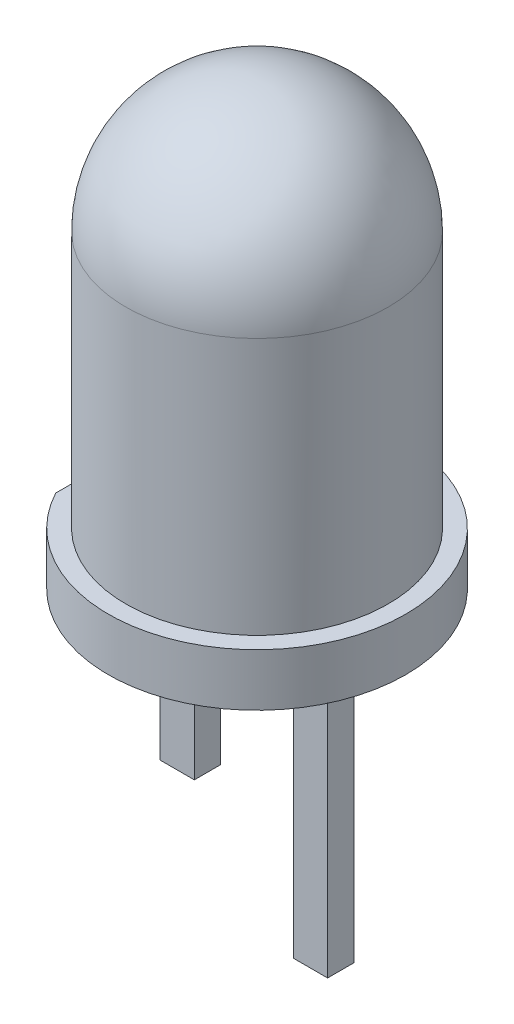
ISO-10303-21;
HEADER;
FILE_DESCRIPTION(('STEP AP214'),'2;1');
FILE_NAME('part.step','',(''),(''),'','','');
FILE_SCHEMA(('AUTOMOTIVE_DESIGN { 1 0 10303 214 1 1 1 1 }'));
ENDSEC;
DATA;
#1=APPLICATION_CONTEXT('core data for automotive mechanical design processes');
#2=APPLICATION_PROTOCOL_DEFINITION('international standard','automotive_design',2000,#1);
#3=PRODUCT_CONTEXT('',#1,'mechanical');
#4=PRODUCT('Part','Part','',(#3));
#5=PRODUCT_RELATED_PRODUCT_CATEGORY('part','',(#4));
#6=PRODUCT_DEFINITION_FORMATION('','',#4);
#7=PRODUCT_DEFINITION_CONTEXT('part definition',#1,'design');
#8=PRODUCT_DEFINITION('design','',#6,#7);
#9=PRODUCT_DEFINITION_SHAPE('','',#8);
#10=(LENGTH_UNIT() NAMED_UNIT(*) SI_UNIT(.MILLI.,.METRE.));
#11=(NAMED_UNIT(*) PLANE_ANGLE_UNIT() SI_UNIT($,.RADIAN.));
#12=(NAMED_UNIT(*) SI_UNIT($,.STERADIAN.) SOLID_ANGLE_UNIT());
#13=UNCERTAINTY_MEASURE_WITH_UNIT(LENGTH_MEASURE(1.E-05),#10,'distance_accuracy_value','');
#14=(GEOMETRIC_REPRESENTATION_CONTEXT(3) GLOBAL_UNCERTAINTY_ASSIGNED_CONTEXT((#13)) GLOBAL_UNIT_ASSIGNED_CONTEXT((#10,
#11,#12)) REPRESENTATION_CONTEXT('',''));
#15=CARTESIAN_POINT('',(0.,0.,0.));
#16=DIRECTION('',(0.,0.,1.));
#17=DIRECTION('',(1.,0.,0.));
#18=AXIS2_PLACEMENT_3D('',#15,#16,#17);
#19=CARTESIAN_POINT('',(-1.595,0.,0.25));
#20=DIRECTION('',(0.,1.,0.));
#21=DIRECTION('',(0.,0.,1.));
#22=AXIS2_PLACEMENT_3D('',#19,#20,#21);
#23=PLANE('',#22);
#24=DIRECTION('',(1.,0.,0.));
#25=VECTOR('',#24,1.);
#26=CARTESIAN_POINT('',(-1.595,0.,-0.25));
#27=LINE('',#26,#25);
#28=CARTESIAN_POINT('',(-1.595,0.,-0.25));
#29=VERTEX_POINT('',#28);
#30=CARTESIAN_POINT('',(-0.945,0.,-0.25));
#31=VERTEX_POINT('',#30);
#32=EDGE_CURVE('E87',#29,#31,#27,.T.);
#33=ORIENTED_EDGE('',*,*,#32,.T.);
#34=DIRECTION('',(0.,0.,-1.));
#35=VECTOR('',#34,1.);
#36=CARTESIAN_POINT('',(-0.945,0.,0.25));
#37=LINE('',#36,#35);
#38=CARTESIAN_POINT('',(-0.945,0.,0.25));
#39=VERTEX_POINT('',#38);
#40=EDGE_CURVE('E12',#39,#31,#37,.T.);
#41=ORIENTED_EDGE('',*,*,#40,.F.);
#42=DIRECTION('',(1.,0.,0.));
#43=VECTOR('',#42,1.);
#44=CARTESIAN_POINT('',(-1.595,0.,0.25));
#45=LINE('',#44,#43);
#46=CARTESIAN_POINT('',(-1.595,0.,0.25));
#47=VERTEX_POINT('',#46);
#48=EDGE_CURVE('E108',#47,#39,#45,.T.);
#49=ORIENTED_EDGE('',*,*,#48,.F.);
#50=DIRECTION('',(0.,0.,-1.));
#51=VECTOR('',#50,1.);
#52=CARTESIAN_POINT('',(-1.595,0.,0.25));
#53=LINE('',#52,#51);
#54=EDGE_CURVE('E100',#47,#29,#53,.T.);
#55=ORIENTED_EDGE('',*,*,#54,.T.);
#56=EDGE_LOOP('',(#33,#41,#49,#55));
#57=FACE_BOUND('',#56,.T.);
#58=ADVANCED_FACE('F37',(#57),#23,.F.);
#59=CARTESIAN_POINT('',(-0.945,0.,0.25));
#60=DIRECTION('',(-1.,0.,0.));
#61=DIRECTION('',(0.,0.,1.));
#62=AXIS2_PLACEMENT_3D('',#59,#60,#61);
#63=PLANE('',#62);
#64=DIRECTION('',(0.,1.,0.));
#65=VECTOR('',#64,1.);
#66=CARTESIAN_POINT('',(-0.945,0.,-0.25));
#67=LINE('',#66,#65);
#68=CARTESIAN_POINT('',(-0.945,0.271653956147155,-0.25));
#69=VERTEX_POINT('',#68);
#70=EDGE_CURVE('E83',#31,#69,#67,.T.);
#71=ORIENTED_EDGE('',*,*,#70,.T.);
#72=DIRECTION('',(0.,0.,-1.));
#73=VECTOR('',#72,1.);
#74=CARTESIAN_POINT('',(-0.945,0.271653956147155,0.25));
#75=LINE('',#74,#73);
#76=CARTESIAN_POINT('',(-0.945,0.271653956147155,0.25));
#77=VERTEX_POINT('',#76);
#78=EDGE_CURVE('E44',#77,#69,#75,.T.);
#79=ORIENTED_EDGE('',*,*,#78,.F.);
#80=DIRECTION('',(0.,1.,0.));
#81=VECTOR('',#80,1.);
#82=CARTESIAN_POINT('',(-0.945,0.,0.25));
#83=LINE('',#82,#81);
#84=EDGE_CURVE('E96',#39,#77,#83,.T.);
#85=ORIENTED_EDGE('',*,*,#84,.F.);
#86=ORIENTED_EDGE('',*,*,#40,.T.);
#87=EDGE_LOOP('',(#71,#79,#85,#86));
#88=FACE_BOUND('',#87,.T.);
#89=ADVANCED_FACE('F95',(#88),#63,.F.);
#90=CARTESIAN_POINT('',(-0.945,0.271653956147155,0.25));
#91=DIRECTION('',(-0.485529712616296,0.874220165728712,0.));
#92=DIRECTION('',(-0.874220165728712,-0.485529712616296,0.));
#93=AXIS2_PLACEMENT_3D('',#90,#91,#92);
#94=PLANE('',#93);
#95=DIRECTION('',(0.874220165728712,0.485529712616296,0.));
#96=VECTOR('',#95,1.);
#97=CARTESIAN_POINT('',(-0.945,0.271653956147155,-0.25));
#98=LINE('',#97,#96);
#99=CARTESIAN_POINT('',(-0.32399866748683,0.616549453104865,-0.25));
#100=VERTEX_POINT('',#99);
#101=EDGE_CURVE('E89',#69,#100,#98,.T.);
#102=ORIENTED_EDGE('',*,*,#101,.T.);
#103=DIRECTION('',(0.,0.,-1.));
#104=VECTOR('',#103,1.);
#105=CARTESIAN_POINT('',(-0.32399866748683,0.616549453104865,0.25));
#106=LINE('',#105,#104);
#107=CARTESIAN_POINT('',(-0.32399866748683,0.616549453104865,0.25));
#108=VERTEX_POINT('',#107);
#109=EDGE_CURVE('E119',#108,#100,#106,.T.);
#110=ORIENTED_EDGE('',*,*,#109,.F.);
#111=DIRECTION('',(0.874220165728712,0.485529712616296,0.));
#112=VECTOR('',#111,1.);
#113=CARTESIAN_POINT('',(-0.945,0.271653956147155,0.25));
#114=LINE('',#113,#112);
#115=EDGE_CURVE('E111',#77,#108,#114,.T.);
#116=ORIENTED_EDGE('',*,*,#115,.F.);
#117=ORIENTED_EDGE('',*,*,#78,.T.);
#118=EDGE_LOOP('',(#102,#110,#116,#117));
#119=FACE_BOUND('',#118,.T.);
#120=ADVANCED_FACE('F123',(#119),#94,.F.);
#121=CARTESIAN_POINT('',(-1.595,3.29327204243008,0.25));
#122=DIRECTION('',(-0.9033352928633,-0.428935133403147,0.));
#123=DIRECTION('',(0.428935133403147,-0.9033352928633,0.));
#124=AXIS2_PLACEMENT_3D('',#121,#122,#123);
#125=PLANE('',#124);
#126=DIRECTION('',(-0.428935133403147,0.9033352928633,0.));
#127=VECTOR('',#126,1.);
#128=CARTESIAN_POINT('',(-1.595,3.29327204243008,-0.25));
#129=LINE('',#128,#127);
#130=CARTESIAN_POINT('',(-1.595,3.29327204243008,-0.25));
#131=VERTEX_POINT('',#130);
#132=EDGE_CURVE('E104',#100,#131,#129,.T.);
#133=ORIENTED_EDGE('',*,*,#132,.T.);
#134=DIRECTION('',(0.,0.,-1.));
#135=VECTOR('',#134,1.);
#136=CARTESIAN_POINT('',(-1.595,3.29327204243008,0.25));
#137=LINE('',#136,#135);
#138=CARTESIAN_POINT('',(-1.595,3.29327204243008,0.25));
#139=VERTEX_POINT('',#138);
#140=EDGE_CURVE('E116',#139,#131,#137,.T.);
#141=ORIENTED_EDGE('',*,*,#140,.F.);
#142=DIRECTION('',(-0.428935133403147,0.9033352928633,0.));
#143=VECTOR('',#142,1.);
#144=CARTESIAN_POINT('',(-1.595,3.29327204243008,0.25));
#145=LINE('',#144,#143);
#146=EDGE_CURVE('E56',#108,#139,#145,.T.);
#147=ORIENTED_EDGE('',*,*,#146,.F.);
#148=ORIENTED_EDGE('',*,*,#109,.T.);
#149=EDGE_LOOP('',(#133,#141,#147,#148));
#150=FACE_BOUND('',#149,.T.);
#151=ADVANCED_FACE('F134',(#150),#125,.F.);
#152=CARTESIAN_POINT('',(-1.595,0.,0.25));
#153=DIRECTION('',(1.,0.,0.));
#154=DIRECTION('',(0.,0.,-1.));
#155=AXIS2_PLACEMENT_3D('',#152,#153,#154);
#156=PLANE('',#155);
#157=DIRECTION('',(0.,-1.,0.));
#158=VECTOR('',#157,1.);
#159=CARTESIAN_POINT('',(-1.595,0.,-0.25));
#160=LINE('',#159,#158);
#161=EDGE_CURVE('E106',#131,#29,#160,.T.);
#162=ORIENTED_EDGE('',*,*,#161,.T.);
#163=ORIENTED_EDGE('',*,*,#54,.F.);
#164=DIRECTION('',(0.,-1.,0.));
#165=VECTOR('',#164,1.);
#166=CARTESIAN_POINT('',(-1.595,0.,0.25));
#167=LINE('',#166,#165);
#168=EDGE_CURVE('E51',#139,#47,#167,.T.);
#169=ORIENTED_EDGE('',*,*,#168,.F.);
#170=ORIENTED_EDGE('',*,*,#140,.T.);
#171=EDGE_LOOP('',(#162,#163,#169,#170));
#172=FACE_BOUND('',#171,.T.);
#173=ADVANCED_FACE('F127',(#172),#156,.F.);
#174=CARTESIAN_POINT('',(-0.945,0.,0.25));
#175=DIRECTION('',(0.,0.,1.));
#176=DIRECTION('',(1.,0.,0.));
#177=AXIS2_PLACEMENT_3D('',#174,#175,#176);
#178=PLANE('',#177);
#179=ORIENTED_EDGE('',*,*,#48,.T.);
#180=ORIENTED_EDGE('',*,*,#84,.T.);
#181=ORIENTED_EDGE('',*,*,#115,.T.);
#182=ORIENTED_EDGE('',*,*,#146,.T.);
#183=ORIENTED_EDGE('',*,*,#168,.T.);
#184=EDGE_LOOP('',(#179,#180,#181,#182,#183));
#185=FACE_BOUND('',#184,.T.);
#186=ADVANCED_FACE('F125',(#185),#178,.T.);
#187=CARTESIAN_POINT('',(-0.945,0.,-0.25));
#188=DIRECTION('',(0.,0.,1.));
#189=DIRECTION('',(1.,0.,0.));
#190=AXIS2_PLACEMENT_3D('',#187,#188,#189);
#191=PLANE('',#190);
#192=ORIENTED_EDGE('',*,*,#32,.F.);
#193=ORIENTED_EDGE('',*,*,#161,.F.);
#194=ORIENTED_EDGE('',*,*,#132,.F.);
#195=ORIENTED_EDGE('',*,*,#101,.F.);
#196=ORIENTED_EDGE('',*,*,#70,.F.);
#197=EDGE_LOOP('',(#192,#193,#194,#195,#196));
#198=FACE_BOUND('',#197,.T.);
#199=ADVANCED_FACE('F84',(#198),#191,.F.);
#200=CLOSED_SHELL('',(#58,#89,#120,#151,#173,#186,#199));
#201=MANIFOLD_SOLID_BREP('B2',#200);
#202=CARTESIAN_POINT('',(1.595,0.,0.25));
#203=DIRECTION('',(0.,1.,0.));
#204=DIRECTION('',(0.,0.,1.));
#205=AXIS2_PLACEMENT_3D('',#202,#203,#204);
#206=PLANE('',#205);
#207=DIRECTION('',(1.,0.,0.));
#208=VECTOR('',#207,1.);
#209=CARTESIAN_POINT('',(1.595,0.,-0.25));
#210=LINE('',#209,#208);
#211=CARTESIAN_POINT('',(0.945,0.,-0.25));
#212=VERTEX_POINT('',#211);
#213=CARTESIAN_POINT('',(1.595,0.,-0.25));
#214=VERTEX_POINT('',#213);
#215=EDGE_CURVE('E255',#212,#214,#210,.T.);
#216=ORIENTED_EDGE('',*,*,#215,.T.);
#217=DIRECTION('',(0.,0.,-1.));
#218=VECTOR('',#217,1.);
#219=CARTESIAN_POINT('',(1.595,0.,0.25));
#220=LINE('',#219,#218);
#221=CARTESIAN_POINT('',(1.595,0.,0.25));
#222=VERTEX_POINT('',#221);
#223=EDGE_CURVE('E35',#222,#214,#220,.T.);
#224=ORIENTED_EDGE('',*,*,#223,.F.);
#225=DIRECTION('',(1.,0.,0.));
#226=VECTOR('',#225,1.);
#227=CARTESIAN_POINT('',(1.595,0.,0.25));
#228=LINE('',#227,#226);
#229=CARTESIAN_POINT('',(0.945,0.,0.25));
#230=VERTEX_POINT('',#229);
#231=EDGE_CURVE('E284',#230,#222,#228,.T.);
#232=ORIENTED_EDGE('',*,*,#231,.F.);
#233=DIRECTION('',(0.,0.,-1.));
#234=VECTOR('',#233,1.);
#235=CARTESIAN_POINT('',(0.945,0.,0.25));
#236=LINE('',#235,#234);
#237=EDGE_CURVE('E268',#230,#212,#236,.T.);
#238=ORIENTED_EDGE('',*,*,#237,.T.);
#239=EDGE_LOOP('',(#216,#224,#232,#238));
#240=FACE_BOUND('',#239,.T.);
#241=ADVANCED_FACE('F181',(#240),#206,.F.);
#242=CARTESIAN_POINT('',(1.595,0.,0.25));
#243=DIRECTION('',(-1.,0.,0.));
#244=DIRECTION('',(0.,-1.,0.));
#245=AXIS2_PLACEMENT_3D('',#242,#243,#244);
#246=PLANE('',#245);
#247=DIRECTION('',(0.,1.,0.));
#248=VECTOR('',#247,1.);
#249=CARTESIAN_POINT('',(1.595,0.,-0.25));
#250=LINE('',#249,#248);
#251=CARTESIAN_POINT('',(1.595,3.5,-0.25));
#252=VERTEX_POINT('',#251);
#253=EDGE_CURVE('E251',#214,#252,#250,.T.);
#254=ORIENTED_EDGE('',*,*,#253,.T.);
#255=DIRECTION('',(0.,0.,-1.));
#256=VECTOR('',#255,1.);
#257=CARTESIAN_POINT('',(1.595,3.5,0.25));
#258=LINE('',#257,#256);
#259=CARTESIAN_POINT('',(1.595,3.5,0.25));
#260=VERTEX_POINT('',#259);
#261=EDGE_CURVE('E188',#260,#252,#258,.T.);
#262=ORIENTED_EDGE('',*,*,#261,.F.);
#263=DIRECTION('',(0.,1.,0.));
#264=VECTOR('',#263,1.);
#265=CARTESIAN_POINT('',(1.595,0.,0.25));
#266=LINE('',#265,#264);
#267=EDGE_CURVE('E264',#222,#260,#266,.T.);
#268=ORIENTED_EDGE('',*,*,#267,.F.);
#269=ORIENTED_EDGE('',*,*,#223,.T.);
#270=EDGE_LOOP('',(#254,#262,#268,#269));
#271=FACE_BOUND('',#270,.T.);
#272=ADVANCED_FACE('F263',(#271),#246,.F.);
#273=CARTESIAN_POINT('',(1.595,3.5,0.25));
#274=DIRECTION('',(0.,-1.,0.));
#275=DIRECTION('',(0.,0.,-1.));
#276=AXIS2_PLACEMENT_3D('',#273,#274,#275);
#277=PLANE('',#276);
#278=DIRECTION('',(-1.,0.,0.));
#279=VECTOR('',#278,1.);
#280=CARTESIAN_POINT('',(1.595,3.5,-0.25));
#281=LINE('',#280,#279);
#282=CARTESIAN_POINT('',(0.80632764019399,3.5,-0.25));
#283=VERTEX_POINT('',#282);
#284=EDGE_CURVE('E257',#252,#283,#281,.T.);
#285=ORIENTED_EDGE('',*,*,#284,.T.);
#286=DIRECTION('',(0.,0.,-1.));
#287=VECTOR('',#286,1.);
#288=CARTESIAN_POINT('',(0.80632764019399,3.5,0.25));
#289=LINE('',#288,#287);
#290=CARTESIAN_POINT('',(0.80632764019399,3.5,0.25));
#291=VERTEX_POINT('',#290);
#292=EDGE_CURVE('E315',#291,#283,#289,.T.);
#293=ORIENTED_EDGE('',*,*,#292,.F.);
#294=DIRECTION('',(-1.,0.,0.));
#295=VECTOR('',#294,1.);
#296=CARTESIAN_POINT('',(1.595,3.5,0.25));
#297=LINE('',#296,#295);
#298=EDGE_CURVE('E287',#260,#291,#297,.T.);
#299=ORIENTED_EDGE('',*,*,#298,.F.);
#300=ORIENTED_EDGE('',*,*,#261,.T.);
#301=EDGE_LOOP('',(#285,#293,#299,#300));
#302=FACE_BOUND('',#301,.T.);
#303=ADVANCED_FACE('F319',(#302),#277,.F.);
#304=CARTESIAN_POINT('',(0.80632764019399,3.5,0.25));
#305=DIRECTION('',(0.796529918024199,-0.604599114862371,0.));
#306=DIRECTION('',(0.604599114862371,0.796529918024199,0.));
#307=AXIS2_PLACEMENT_3D('',#304,#305,#306);
#308=PLANE('',#307);
#309=DIRECTION('',(-0.604599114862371,-0.796529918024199,0.));
#310=VECTOR('',#309,1.);
#311=CARTESIAN_POINT('',(0.80632764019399,3.5,-0.25));
#312=LINE('',#311,#310);
#313=CARTESIAN_POINT('',(0.521534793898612,3.12479928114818,-0.25));
#314=VERTEX_POINT('',#313);
#315=EDGE_CURVE('E272',#283,#314,#312,.T.);
#316=ORIENTED_EDGE('',*,*,#315,.T.);
#317=DIRECTION('',(0.,0.,-1.));
#318=VECTOR('',#317,1.);
#319=CARTESIAN_POINT('',(0.521534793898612,3.12479928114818,0.25));
#320=LINE('',#319,#318);
#321=CARTESIAN_POINT('',(0.521534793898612,3.12479928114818,0.25));
#322=VERTEX_POINT('',#321);
#323=EDGE_CURVE('E312',#322,#314,#320,.T.);
#324=ORIENTED_EDGE('',*,*,#323,.F.);
#325=DIRECTION('',(-0.604599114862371,-0.796529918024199,0.));
#326=VECTOR('',#325,1.);
#327=CARTESIAN_POINT('',(0.80632764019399,3.5,0.25));
#328=LINE('',#327,#326);
#329=EDGE_CURVE('E289',#291,#322,#328,.T.);
#330=ORIENTED_EDGE('',*,*,#329,.F.);
#331=ORIENTED_EDGE('',*,*,#292,.T.);
#332=EDGE_LOOP('',(#316,#324,#330,#331));
#333=FACE_BOUND('',#332,.T.);
#334=ADVANCED_FACE('F327',(#333),#308,.F.);
#335=CARTESIAN_POINT('',(0.123269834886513,3.42709883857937,0.25));
#336=DIRECTION('',(0.,0.,-1.));
#337=DIRECTION('',(-1.,0.,0.));
#338=AXIS2_PLACEMENT_3D('',#335,#336,#337);
#339=CYLINDRICAL_SURFACE('',#338,0.5);
#340=CARTESIAN_POINT('',(0.123269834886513,3.42709883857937,-0.25));
#341=DIRECTION('',(0.,0.,-1.));
#342=DIRECTION('',(1.,0.,0.));
#343=AXIS2_PLACEMENT_3D('',#340,#341,#342);
#344=CIRCLE('',#343,0.5);
#345=CARTESIAN_POINT('',(-0.103725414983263,2.98159557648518,-0.25));
#346=VERTEX_POINT('',#345);
#347=EDGE_CURVE('E274',#314,#346,#344,.T.);
#348=ORIENTED_EDGE('',*,*,#347,.T.);
#349=DIRECTION('',(0.,0.,-1.));
#350=VECTOR('',#349,1.);
#351=CARTESIAN_POINT('',(-0.103725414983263,2.98159557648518,0.25));
#352=LINE('',#351,#350);
#353=CARTESIAN_POINT('',(-0.103725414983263,2.98159557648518,0.25));
#354=VERTEX_POINT('',#353);
#355=EDGE_CURVE('E309',#354,#346,#352,.T.);
#356=ORIENTED_EDGE('',*,*,#355,.F.);
#357=CARTESIAN_POINT('',(0.123269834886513,3.42709883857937,0.25));
#358=DIRECTION('',(0.,0.,-1.));
#359=DIRECTION('',(1.,0.,0.));
#360=AXIS2_PLACEMENT_3D('',#357,#358,#359);
#361=CIRCLE('',#360,0.5);
#362=EDGE_CURVE('E291',#322,#354,#361,.T.);
#363=ORIENTED_EDGE('',*,*,#362,.F.);
#364=ORIENTED_EDGE('',*,*,#323,.T.);
#365=EDGE_LOOP('',(#348,#356,#363,#364));
#366=FACE_BOUND('',#365,.T.);
#367=ADVANCED_FACE('F330',(#366),#339,.F.);
#368=CARTESIAN_POINT('',(-1.29298369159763,3.58755293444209,0.25));
#369=DIRECTION('',(-0.453990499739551,-0.891006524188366,0.));
#370=DIRECTION('',(0.891006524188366,-0.453990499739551,0.));
#371=AXIS2_PLACEMENT_3D('',#368,#369,#370);
#372=PLANE('',#371);
#373=DIRECTION('',(-0.891006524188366,0.453990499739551,0.));
#374=VECTOR('',#373,1.);
#375=CARTESIAN_POINT('',(-1.29298369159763,3.58755293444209,-0.25));
#376=LINE('',#375,#374);
#377=CARTESIAN_POINT('',(-1.29298369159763,3.58755293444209,-0.25));
#378=VERTEX_POINT('',#377);
#379=EDGE_CURVE('E276',#346,#378,#376,.T.);
#380=ORIENTED_EDGE('',*,*,#379,.T.);
#381=DIRECTION('',(0.,0.,-1.));
#382=VECTOR('',#381,1.);
#383=CARTESIAN_POINT('',(-1.29298369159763,3.58755293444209,0.25));
#384=LINE('',#383,#382);
#385=CARTESIAN_POINT('',(-1.29298369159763,3.58755293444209,0.25));
#386=VERTEX_POINT('',#385);
#387=EDGE_CURVE('E306',#386,#378,#384,.T.);
#388=ORIENTED_EDGE('',*,*,#387,.F.);
#389=DIRECTION('',(-0.891006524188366,0.453990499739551,0.));
#390=VECTOR('',#389,1.);
#391=CARTESIAN_POINT('',(-1.29298369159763,3.58755293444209,0.25));
#392=LINE('',#391,#390);
#393=EDGE_CURVE('E293',#354,#386,#392,.T.);
#394=ORIENTED_EDGE('',*,*,#393,.F.);
#395=ORIENTED_EDGE('',*,*,#355,.T.);
#396=EDGE_LOOP('',(#380,#388,#394,#395));
#397=FACE_BOUND('',#396,.T.);
#398=ADVANCED_FACE('F335',(#397),#372,.F.);
#399=CARTESIAN_POINT('',(0.231099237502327,0.377841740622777,0.25));
#400=DIRECTION('',(0.9033352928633,0.428935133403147,0.));
#401=DIRECTION('',(-0.428935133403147,0.9033352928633,0.));
#402=AXIS2_PLACEMENT_3D('',#399,#400,#401);
#403=PLANE('',#402);
#404=DIRECTION('',(0.428935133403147,-0.9033352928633,0.));
#405=VECTOR('',#404,1.);
#406=CARTESIAN_POINT('',(0.231099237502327,0.377841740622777,-0.25));
#407=LINE('',#406,#405);
#408=CARTESIAN_POINT('',(0.231099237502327,0.377841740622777,-0.25));
#409=VERTEX_POINT('',#408);
#410=EDGE_CURVE('E278',#378,#409,#407,.T.);
#411=ORIENTED_EDGE('',*,*,#410,.T.);
#412=DIRECTION('',(0.,0.,-1.));
#413=VECTOR('',#412,1.);
#414=CARTESIAN_POINT('',(0.231099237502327,0.377841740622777,0.25));
#415=LINE('',#414,#413);
#416=CARTESIAN_POINT('',(0.231099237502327,0.377841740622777,0.25));
#417=VERTEX_POINT('',#416);
#418=EDGE_CURVE('E303',#417,#409,#415,.T.);
#419=ORIENTED_EDGE('',*,*,#418,.F.);
#420=DIRECTION('',(0.428935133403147,-0.9033352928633,0.));
#421=VECTOR('',#420,1.);
#422=CARTESIAN_POINT('',(0.231099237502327,0.377841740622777,0.25));
#423=LINE('',#422,#421);
#424=EDGE_CURVE('E295',#386,#417,#423,.T.);
#425=ORIENTED_EDGE('',*,*,#424,.F.);
#426=ORIENTED_EDGE('',*,*,#387,.T.);
#427=EDGE_LOOP('',(#411,#419,#425,#426));
#428=FACE_BOUND('',#427,.T.);
#429=ADVANCED_FACE('F339',(#428),#403,.F.);
#430=CARTESIAN_POINT('',(0.945,0.23,0.25));
#431=DIRECTION('',(0.202787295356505,0.979222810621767,0.));
#432=DIRECTION('',(-0.979222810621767,0.202787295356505,0.));
#433=AXIS2_PLACEMENT_3D('',#430,#431,#432);
#434=PLANE('',#433);
#435=DIRECTION('',(0.979222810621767,-0.202787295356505,0.));
#436=VECTOR('',#435,1.);
#437=CARTESIAN_POINT('',(0.945,0.23,-0.25));
#438=LINE('',#437,#436);
#439=CARTESIAN_POINT('',(0.945,0.23,-0.25));
#440=VERTEX_POINT('',#439);
#441=EDGE_CURVE('E280',#409,#440,#438,.T.);
#442=ORIENTED_EDGE('',*,*,#441,.T.);
#443=DIRECTION('',(0.,0.,-1.));
#444=VECTOR('',#443,1.);
#445=CARTESIAN_POINT('',(0.945,0.23,0.25));
#446=LINE('',#445,#444);
#447=CARTESIAN_POINT('',(0.945,0.23,0.25));
#448=VERTEX_POINT('',#447);
#449=EDGE_CURVE('E300',#448,#440,#446,.T.);
#450=ORIENTED_EDGE('',*,*,#449,.F.);
#451=DIRECTION('',(0.979222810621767,-0.202787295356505,0.));
#452=VECTOR('',#451,1.);
#453=CARTESIAN_POINT('',(0.945,0.23,0.25));
#454=LINE('',#453,#452);
#455=EDGE_CURVE('E200',#417,#448,#454,.T.);
#456=ORIENTED_EDGE('',*,*,#455,.F.);
#457=ORIENTED_EDGE('',*,*,#418,.T.);
#458=EDGE_LOOP('',(#442,#450,#456,#457));
#459=FACE_BOUND('',#458,.T.);
#460=ADVANCED_FACE('F343',(#459),#434,.F.);
#461=CARTESIAN_POINT('',(0.945,0.,0.25));
#462=DIRECTION('',(1.,0.,0.));
#463=DIRECTION('',(0.,0.,-1.));
#464=AXIS2_PLACEMENT_3D('',#461,#462,#463);
#465=PLANE('',#464);
#466=DIRECTION('',(0.,-1.,0.));
#467=VECTOR('',#466,1.);
#468=CARTESIAN_POINT('',(0.945,0.,-0.25));
#469=LINE('',#468,#467);
#470=EDGE_CURVE('E282',#440,#212,#469,.T.);
#471=ORIENTED_EDGE('',*,*,#470,.T.);
#472=ORIENTED_EDGE('',*,*,#237,.F.);
#473=DIRECTION('',(0.,-1.,0.));
#474=VECTOR('',#473,1.);
#475=CARTESIAN_POINT('',(0.945,0.,0.25));
#476=LINE('',#475,#474);
#477=EDGE_CURVE('E195',#448,#230,#476,.T.);
#478=ORIENTED_EDGE('',*,*,#477,.F.);
#479=ORIENTED_EDGE('',*,*,#449,.T.);
#480=EDGE_LOOP('',(#471,#472,#478,#479));
#481=FACE_BOUND('',#480,.T.);
#482=ADVANCED_FACE('F345',(#481),#465,.F.);
#483=CARTESIAN_POINT('',(0.123269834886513,3.42709883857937,0.25));
#484=DIRECTION('',(0.,0.,1.));
#485=DIRECTION('',(1.,0.,0.));
#486=AXIS2_PLACEMENT_3D('',#483,#484,#485);
#487=PLANE('',#486);
#488=ORIENTED_EDGE('',*,*,#231,.T.);
#489=ORIENTED_EDGE('',*,*,#267,.T.);
#490=ORIENTED_EDGE('',*,*,#298,.T.);
#491=ORIENTED_EDGE('',*,*,#329,.T.);
#492=ORIENTED_EDGE('',*,*,#362,.T.);
#493=ORIENTED_EDGE('',*,*,#393,.T.);
#494=ORIENTED_EDGE('',*,*,#424,.T.);
#495=ORIENTED_EDGE('',*,*,#455,.T.);
#496=ORIENTED_EDGE('',*,*,#477,.T.);
#497=EDGE_LOOP('',(#488,#489,#490,#491,#492,#493,#494,#495,#496));
#498=FACE_BOUND('',#497,.T.);
#499=ADVANCED_FACE('F322',(#498),#487,.T.);
#500=CARTESIAN_POINT('',(0.123269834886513,3.42709883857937,-0.25));
#501=DIRECTION('',(0.,0.,1.));
#502=DIRECTION('',(1.,0.,0.));
#503=AXIS2_PLACEMENT_3D('',#500,#501,#502);
#504=PLANE('',#503);
#505=ORIENTED_EDGE('',*,*,#215,.F.);
#506=ORIENTED_EDGE('',*,*,#470,.F.);
#507=ORIENTED_EDGE('',*,*,#441,.F.);
#508=ORIENTED_EDGE('',*,*,#410,.F.);
#509=ORIENTED_EDGE('',*,*,#379,.F.);
#510=ORIENTED_EDGE('',*,*,#347,.F.);
#511=ORIENTED_EDGE('',*,*,#315,.F.);
#512=ORIENTED_EDGE('',*,*,#284,.F.);
#513=ORIENTED_EDGE('',*,*,#253,.F.);
#514=EDGE_LOOP('',(#505,#506,#507,#508,#509,#510,#511,#512,#513));
#515=FACE_BOUND('',#514,.T.);
#516=ADVANCED_FACE('F252',(#515),#504,.F.);
#517=CLOSED_SHELL('',(#241,#272,#303,#334,#367,#398,#429,#460,#482,#499,#516));
#518=MANIFOLD_SOLID_BREP('B6',#517);
#519=CARTESIAN_POINT('',(-2.835,0.,0.));
#520=DIRECTION('',(0.,1.,0.));
#521=DIRECTION('',(0.,0.,1.));
#522=AXIS2_PLACEMENT_3D('',#519,#520,#521);
#523=PLANE('',#522);
#524=DIRECTION('',(-1.,0.,0.));
#525=VECTOR('',#524,1.);
#526=CARTESIAN_POINT('',(-0.945,0.,0.25));
#527=LINE('',#526,#525);
#528=CARTESIAN_POINT('',(-0.945,0.,0.25));
#529=VERTEX_POINT('',#528);
#530=CARTESIAN_POINT('',(-1.595,0.,0.25));
#531=VERTEX_POINT('',#530);
#532=EDGE_CURVE('E588',#529,#531,#527,.T.);
#533=ORIENTED_EDGE('',*,*,#532,.F.);
#534=DIRECTION('',(0.,0.,1.));
#535=VECTOR('',#534,1.);
#536=CARTESIAN_POINT('',(-0.945,0.,0.25));
#537=LINE('',#536,#535);
#538=CARTESIAN_POINT('',(-0.945,0.,-0.25));
#539=VERTEX_POINT('',#538);
#540=EDGE_CURVE('E509',#539,#529,#537,.T.);
#541=ORIENTED_EDGE('',*,*,#540,.F.);
#542=DIRECTION('',(1.,0.,0.));
#543=VECTOR('',#542,1.);
#544=CARTESIAN_POINT('',(-0.945,0.,-0.25));
#545=LINE('',#544,#543);
#546=CARTESIAN_POINT('',(-1.595,0.,-0.25));
#547=VERTEX_POINT('',#546);
#548=EDGE_CURVE('E514',#547,#539,#545,.T.);
#549=ORIENTED_EDGE('',*,*,#548,.F.);
#550=DIRECTION('',(0.,0.,-1.));
#551=VECTOR('',#550,1.);
#552=CARTESIAN_POINT('',(-1.595,0.,0.25));
#553=LINE('',#552,#551);
#554=EDGE_CURVE('E590',#531,#547,#553,.T.);
#555=ORIENTED_EDGE('',*,*,#554,.F.);
#556=EDGE_LOOP('',(#533,#541,#549,#555));
#557=FACE_BOUND('',#556,.T.);
#558=CARTESIAN_POINT('',(0.,0.,0.));
#559=DIRECTION('',(0.,-1.,0.));
#560=DIRECTION('',(0.,0.,-1.));
#561=AXIS2_PLACEMENT_3D('',#558,#559,#560);
#562=CIRCLE('',#561,2.835);
#563=CARTESIAN_POINT('',(-2.5,0.,-1.33687134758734));
#564=VERTEX_POINT('',#563);
#565=CARTESIAN_POINT('',(-2.5,0.,1.33687134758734));
#566=VERTEX_POINT('',#565);
#567=EDGE_CURVE('E179',#564,#566,#562,.T.);
#568=ORIENTED_EDGE('',*,*,#567,.T.);
#569=DIRECTION('',(0.,0.,1.));
#570=VECTOR('',#569,1.);
#571=CARTESIAN_POINT('',(-2.5,0.,-5.));
#572=LINE('',#571,#570);
#573=EDGE_CURVE('E521',#564,#566,#572,.T.);
#574=ORIENTED_EDGE('',*,*,#573,.F.);
#575=EDGE_LOOP('',(#568,#574));
#576=FACE_BOUND('',#575,.T.);
#577=DIRECTION('',(0.,0.,-1.));
#578=VECTOR('',#577,1.);
#579=CARTESIAN_POINT('',(0.945,0.,0.25));
#580=LINE('',#579,#578);
#581=CARTESIAN_POINT('',(0.945,0.,0.25));
#582=VERTEX_POINT('',#581);
#583=CARTESIAN_POINT('',(0.945,0.,-0.25));
#584=VERTEX_POINT('',#583);
#585=EDGE_CURVE('E553',#582,#584,#580,.T.);
#586=ORIENTED_EDGE('',*,*,#585,.F.);
#587=DIRECTION('',(-1.,0.,0.));
#588=VECTOR('',#587,1.);
#589=CARTESIAN_POINT('',(0.945,0.,0.25));
#590=LINE('',#589,#588);
#591=CARTESIAN_POINT('',(1.595,0.,0.25));
#592=VERTEX_POINT('',#591);
#593=EDGE_CURVE('E555',#592,#582,#590,.T.);
#594=ORIENTED_EDGE('',*,*,#593,.F.);
#595=DIRECTION('',(0.,0.,1.));
#596=VECTOR('',#595,1.);
#597=CARTESIAN_POINT('',(1.595,0.,0.25));
#598=LINE('',#597,#596);
#599=CARTESIAN_POINT('',(1.595,0.,-0.25));
#600=VERTEX_POINT('',#599);
#601=EDGE_CURVE('E572',#600,#592,#598,.T.);
#602=ORIENTED_EDGE('',*,*,#601,.F.);
#603=DIRECTION('',(1.,0.,0.));
#604=VECTOR('',#603,1.);
#605=CARTESIAN_POINT('',(0.945,0.,-0.25));
#606=LINE('',#605,#604);
#607=EDGE_CURVE('E435',#584,#600,#606,.T.);
#608=ORIENTED_EDGE('',*,*,#607,.F.);
#609=EDGE_LOOP('',(#586,#594,#602,#608));
#610=FACE_BOUND('',#609,.T.);
#611=ADVANCED_FACE('F412',(#557,#576,#610),#523,.F.);
#612=CARTESIAN_POINT('',(0.,5.9,0.));
#613=DIRECTION('',(0.,-1.,0.));
#614=DIRECTION('',(1.,0.,0.));
#615=AXIS2_PLACEMENT_3D('',#612,#613,#614);
#616=SPHERICAL_SURFACE('',#615,2.5);
#617=CARTESIAN_POINT('',(0.,5.9,0.));
#618=DIRECTION('',(0.,-1.,0.));
#619=DIRECTION('',(0.,0.,-1.));
#620=AXIS2_PLACEMENT_3D('',#617,#618,#619);
#621=CIRCLE('',#620,2.5);
#622=CARTESIAN_POINT('',(0.,5.9,-2.5));
#623=VERTEX_POINT('',#622);
#624=EDGE_CURVE('E532',#623,#623,#621,.T.);
#625=ORIENTED_EDGE('',*,*,#624,.F.);
#626=EDGE_LOOP('',(#625));
#627=FACE_BOUND('',#626,.T.);
#628=ADVANCED_FACE('F414',(#627),#616,.T.);
#629=CARTESIAN_POINT('',(0.,0.,0.));
#630=DIRECTION('',(0.,-1.,0.));
#631=DIRECTION('',(0.,0.,-1.));
#632=AXIS2_PLACEMENT_3D('',#629,#630,#631);
#633=CYLINDRICAL_SURFACE('',#632,2.835);
#634=CARTESIAN_POINT('',(0.,1.,0.));
#635=DIRECTION('',(0.,-1.,0.));
#636=DIRECTION('',(0.,0.,-1.));
#637=AXIS2_PLACEMENT_3D('',#634,#635,#636);
#638=CIRCLE('',#637,2.835);
#639=CARTESIAN_POINT('',(-2.5,1.,-1.33687134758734));
#640=VERTEX_POINT('',#639);
#641=CARTESIAN_POINT('',(-2.5,1.,1.33687134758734));
#642=VERTEX_POINT('',#641);
#643=EDGE_CURVE('E420',#640,#642,#638,.T.);
#644=ORIENTED_EDGE('',*,*,#643,.T.);
#645=DIRECTION('',(0.,-1.,0.));
#646=VECTOR('',#645,1.);
#647=CARTESIAN_POINT('',(-2.5,0.,1.33687134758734));
#648=LINE('',#647,#646);
#649=EDGE_CURVE('E529',#642,#566,#648,.T.);
#650=ORIENTED_EDGE('',*,*,#649,.T.);
#651=ORIENTED_EDGE('',*,*,#567,.F.);
#652=DIRECTION('',(0.,-1.,0.));
#653=VECTOR('',#652,1.);
#654=CARTESIAN_POINT('',(-2.5,0.,-1.33687134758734));
#655=LINE('',#654,#653);
#656=EDGE_CURVE('E523',#564,#640,#655,.F.);
#657=ORIENTED_EDGE('',*,*,#656,.T.);
#658=EDGE_LOOP('',(#644,#650,#651,#657));
#659=FACE_BOUND('',#658,.T.);
#660=ADVANCED_FACE('F540',(#659),#633,.T.);
#661=CARTESIAN_POINT('',(-2.5,1.,0.));
#662=DIRECTION('',(0.,-1.,0.));
#663=DIRECTION('',(0.,0.,-1.));
#664=AXIS2_PLACEMENT_3D('',#661,#662,#663);
#665=PLANE('',#664);
#666=ORIENTED_EDGE('',*,*,#643,.F.);
#667=DIRECTION('',(0.,0.,1.));
#668=VECTOR('',#667,1.);
#669=CARTESIAN_POINT('',(-2.5,1.,-5.));
#670=LINE('',#669,#668);
#671=CARTESIAN_POINT('',(-2.5,1.,0.));
#672=VERTEX_POINT('',#671);
#673=EDGE_CURVE('E524',#640,#672,#670,.T.);
#674=ORIENTED_EDGE('',*,*,#673,.T.);
#675=CARTESIAN_POINT('',(0.,1.,0.));
#676=DIRECTION('',(0.,-1.,0.));
#677=DIRECTION('',(0.,0.,-1.));
#678=AXIS2_PLACEMENT_3D('',#675,#676,#677);
#679=CIRCLE('',#678,2.5);
#680=EDGE_CURVE('E535',#672,#672,#679,.T.);
#681=ORIENTED_EDGE('',*,*,#680,.T.);
#682=EDGE_CURVE('E520',#672,#642,#670,.T.);
#683=ORIENTED_EDGE('',*,*,#682,.T.);
#684=EDGE_LOOP('',(#666,#674,#681,#683));
#685=FACE_BOUND('',#684,.T.);
#686=ADVANCED_FACE('F544',(#685),#665,.F.);
#687=CARTESIAN_POINT('',(0.,0.,0.));
#688=DIRECTION('',(0.,-1.,0.));
#689=DIRECTION('',(0.,0.,-1.));
#690=AXIS2_PLACEMENT_3D('',#687,#688,#689);
#691=CYLINDRICAL_SURFACE('',#690,2.5);
#692=ORIENTED_EDGE('',*,*,#680,.F.);
#693=EDGE_LOOP('',(#692));
#694=FACE_BOUND('',#693,.T.);
#695=ORIENTED_EDGE('',*,*,#624,.T.);
#696=EDGE_LOOP('',(#695));
#697=FACE_BOUND('',#696,.T.);
#698=ADVANCED_FACE('F635',(#694,#697),#691,.T.);
#699=CARTESIAN_POINT('',(-2.5,1.,-5.));
#700=DIRECTION('',(1.,0.,0.));
#701=DIRECTION('',(0.,0.,-1.));
#702=AXIS2_PLACEMENT_3D('',#699,#700,#701);
#703=PLANE('',#702);
#704=ORIENTED_EDGE('',*,*,#682,.F.);
#705=ORIENTED_EDGE('',*,*,#673,.F.);
#706=ORIENTED_EDGE('',*,*,#656,.F.);
#707=ORIENTED_EDGE('',*,*,#573,.T.);
#708=ORIENTED_EDGE('',*,*,#649,.F.);
#709=EDGE_LOOP('',(#704,#705,#706,#707,#708));
#710=FACE_BOUND('',#709,.T.);
#711=ADVANCED_FACE('F547',(#710),#703,.F.);
#712=CARTESIAN_POINT('',(-0.945,-5.5,0.25));
#713=DIRECTION('',(0.,0.,-1.));
#714=DIRECTION('',(-1.,0.,0.));
#715=AXIS2_PLACEMENT_3D('',#712,#713,#714);
#716=PLANE('',#715);
#717=DIRECTION('',(0.,1.,0.));
#718=VECTOR('',#717,1.);
#719=CARTESIAN_POINT('',(-1.595,-5.5,0.25));
#720=LINE('',#719,#718);
#721=CARTESIAN_POINT('',(-1.595,-3.5,0.25));
#722=VERTEX_POINT('',#721);
#723=EDGE_CURVE('E504',#722,#531,#720,.T.);
#724=ORIENTED_EDGE('',*,*,#723,.F.);
#725=DIRECTION('',(-1.,0.,0.));
#726=VECTOR('',#725,1.);
#727=CARTESIAN_POINT('',(-0.945,-3.5,0.25));
#728=LINE('',#727,#726);
#729=CARTESIAN_POINT('',(-0.945,-3.5,0.25));
#730=VERTEX_POINT('',#729);
#731=EDGE_CURVE('E492',#730,#722,#728,.T.);
#732=ORIENTED_EDGE('',*,*,#731,.F.);
#733=DIRECTION('',(0.,1.,0.));
#734=VECTOR('',#733,1.);
#735=CARTESIAN_POINT('',(-0.945,-5.5,0.25));
#736=LINE('',#735,#734);
#737=EDGE_CURVE('E502',#730,#529,#736,.T.);
#738=ORIENTED_EDGE('',*,*,#737,.T.);
#739=ORIENTED_EDGE('',*,*,#532,.T.);
#740=EDGE_LOOP('',(#724,#732,#738,#739));
#741=FACE_BOUND('',#740,.T.);
#742=ADVANCED_FACE('F500',(#741),#716,.F.);
#743=CARTESIAN_POINT('',(-1.595,-5.5,0.25));
#744=DIRECTION('',(1.,0.,0.));
#745=DIRECTION('',(0.,0.,-1.));
#746=AXIS2_PLACEMENT_3D('',#743,#744,#745);
#747=PLANE('',#746);
#748=DIRECTION('',(0.,1.,0.));
#749=VECTOR('',#748,1.);
#750=CARTESIAN_POINT('',(-1.595,-5.5,-0.25));
#751=LINE('',#750,#749);
#752=CARTESIAN_POINT('',(-1.595,-3.5,-0.25));
#753=VERTEX_POINT('',#752);
#754=EDGE_CURVE('E512',#753,#547,#751,.T.);
#755=ORIENTED_EDGE('',*,*,#754,.F.);
#756=DIRECTION('',(0.,0.,1.));
#757=VECTOR('',#756,1.);
#758=CARTESIAN_POINT('',(-1.595,-3.5,0.25));
#759=LINE('',#758,#757);
#760=EDGE_CURVE('E560',#753,#722,#759,.T.);
#761=ORIENTED_EDGE('',*,*,#760,.T.);
#762=ORIENTED_EDGE('',*,*,#723,.T.);
#763=ORIENTED_EDGE('',*,*,#554,.T.);
#764=EDGE_LOOP('',(#755,#761,#762,#763));
#765=FACE_BOUND('',#764,.T.);
#766=ADVANCED_FACE('F599',(#765),#747,.F.);
#767=CARTESIAN_POINT('',(-0.945,-5.5,-0.25));
#768=DIRECTION('',(0.,0.,1.));
#769=DIRECTION('',(1.,0.,0.));
#770=AXIS2_PLACEMENT_3D('',#767,#768,#769);
#771=PLANE('',#770);
#772=DIRECTION('',(0.,1.,0.));
#773=VECTOR('',#772,1.);
#774=CARTESIAN_POINT('',(-0.945,-5.5,-0.25));
#775=LINE('',#774,#773);
#776=CARTESIAN_POINT('',(-0.945,-3.5,-0.25));
#777=VERTEX_POINT('',#776);
#778=EDGE_CURVE('E510',#777,#539,#775,.T.);
#779=ORIENTED_EDGE('',*,*,#778,.F.);
#780=DIRECTION('',(-1.,0.,0.));
#781=VECTOR('',#780,1.);
#782=CARTESIAN_POINT('',(-0.945000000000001,-3.5,-0.25));
#783=LINE('',#782,#781);
#784=EDGE_CURVE('E427',#777,#753,#783,.T.);
#785=ORIENTED_EDGE('',*,*,#784,.T.);
#786=ORIENTED_EDGE('',*,*,#754,.T.);
#787=ORIENTED_EDGE('',*,*,#548,.T.);
#788=EDGE_LOOP('',(#779,#785,#786,#787));
#789=FACE_BOUND('',#788,.T.);
#790=ADVANCED_FACE('F595',(#789),#771,.F.);
#791=CARTESIAN_POINT('',(-0.945,-5.5,0.25));
#792=DIRECTION('',(-1.,0.,0.));
#793=DIRECTION('',(0.,0.,1.));
#794=AXIS2_PLACEMENT_3D('',#791,#792,#793);
#795=PLANE('',#794);
#796=ORIENTED_EDGE('',*,*,#737,.F.);
#797=DIRECTION('',(0.,0.,1.));
#798=VECTOR('',#797,1.);
#799=CARTESIAN_POINT('',(-0.945,-3.5,-2.835));
#800=LINE('',#799,#798);
#801=EDGE_CURVE('E489',#777,#730,#800,.T.);
#802=ORIENTED_EDGE('',*,*,#801,.F.);
#803=ORIENTED_EDGE('',*,*,#778,.T.);
#804=ORIENTED_EDGE('',*,*,#540,.T.);
#805=EDGE_LOOP('',(#796,#802,#803,#804));
#806=FACE_BOUND('',#805,.T.);
#807=ADVANCED_FACE('F507',(#806),#795,.F.);
#808=CARTESIAN_POINT('',(0.945,-5.5,0.25));
#809=DIRECTION('',(1.,0.,0.));
#810=DIRECTION('',(0.,0.,-1.));
#811=AXIS2_PLACEMENT_3D('',#808,#809,#810);
#812=PLANE('',#811);
#813=ORIENTED_EDGE('',*,*,#585,.T.);
#814=DIRECTION('',(0.,1.,0.));
#815=VECTOR('',#814,1.);
#816=CARTESIAN_POINT('',(0.945,-5.5,-0.25));
#817=LINE('',#816,#815);
#818=CARTESIAN_POINT('',(0.945,-5.5,-0.25));
#819=VERTEX_POINT('',#818);
#820=EDGE_CURVE('E586',#819,#584,#817,.T.);
#821=ORIENTED_EDGE('',*,*,#820,.F.);
#822=DIRECTION('',(0.,0.,-1.));
#823=VECTOR('',#822,1.);
#824=CARTESIAN_POINT('',(0.945,-5.5,0.25));
#825=LINE('',#824,#823);
#826=CARTESIAN_POINT('',(0.945,-5.5,0.25));
#827=VERTEX_POINT('',#826);
#828=EDGE_CURVE('E571',#827,#819,#825,.T.);
#829=ORIENTED_EDGE('',*,*,#828,.F.);
#830=DIRECTION('',(0.,1.,0.));
#831=VECTOR('',#830,1.);
#832=CARTESIAN_POINT('',(0.945,-5.5,0.25));
#833=LINE('',#832,#831);
#834=EDGE_CURVE('E567',#827,#582,#833,.T.);
#835=ORIENTED_EDGE('',*,*,#834,.T.);
#836=EDGE_LOOP('',(#813,#821,#829,#835));
#837=FACE_BOUND('',#836,.T.);
#838=ADVANCED_FACE('F574',(#837),#812,.F.);
#839=CARTESIAN_POINT('',(0.945,-5.5,-0.25));
#840=DIRECTION('',(0.,0.,1.));
#841=DIRECTION('',(1.,0.,0.));
#842=AXIS2_PLACEMENT_3D('',#839,#840,#841);
#843=PLANE('',#842);
#844=ORIENTED_EDGE('',*,*,#607,.T.);
#845=DIRECTION('',(0.,1.,0.));
#846=VECTOR('',#845,1.);
#847=CARTESIAN_POINT('',(1.595,-5.5,-0.25));
#848=LINE('',#847,#846);
#849=CARTESIAN_POINT('',(1.595,-5.5,-0.25));
#850=VERTEX_POINT('',#849);
#851=EDGE_CURVE('E578',#850,#600,#848,.T.);
#852=ORIENTED_EDGE('',*,*,#851,.F.);
#853=DIRECTION('',(1.,0.,0.));
#854=VECTOR('',#853,1.);
#855=CARTESIAN_POINT('',(0.945,-5.5,-0.25));
#856=LINE('',#855,#854);
#857=EDGE_CURVE('E606',#819,#850,#856,.T.);
#858=ORIENTED_EDGE('',*,*,#857,.F.);
#859=ORIENTED_EDGE('',*,*,#820,.T.);
#860=EDGE_LOOP('',(#844,#852,#858,#859));
#861=FACE_BOUND('',#860,.T.);
#862=ADVANCED_FACE('F614',(#861),#843,.F.);
#863=CARTESIAN_POINT('',(1.595,-5.5,0.25));
#864=DIRECTION('',(-1.,0.,0.));
#865=DIRECTION('',(0.,0.,1.));
#866=AXIS2_PLACEMENT_3D('',#863,#864,#865);
#867=PLANE('',#866);
#868=ORIENTED_EDGE('',*,*,#601,.T.);
#869=DIRECTION('',(0.,1.,0.));
#870=VECTOR('',#869,1.);
#871=CARTESIAN_POINT('',(1.595,-5.5,0.25));
#872=LINE('',#871,#870);
#873=CARTESIAN_POINT('',(1.595,-5.5,0.25));
#874=VERTEX_POINT('',#873);
#875=EDGE_CURVE('E570',#874,#592,#872,.T.);
#876=ORIENTED_EDGE('',*,*,#875,.F.);
#877=DIRECTION('',(0.,0.,1.));
#878=VECTOR('',#877,1.);
#879=CARTESIAN_POINT('',(1.595,-5.5,0.25));
#880=LINE('',#879,#878);
#881=EDGE_CURVE('E580',#850,#874,#880,.T.);
#882=ORIENTED_EDGE('',*,*,#881,.F.);
#883=ORIENTED_EDGE('',*,*,#851,.T.);
#884=EDGE_LOOP('',(#868,#876,#882,#883));
#885=FACE_BOUND('',#884,.T.);
#886=ADVANCED_FACE('F612',(#885),#867,.F.);
#887=CARTESIAN_POINT('',(0.945,-5.5,0.25));
#888=DIRECTION('',(0.,0.,-1.));
#889=DIRECTION('',(-1.,0.,0.));
#890=AXIS2_PLACEMENT_3D('',#887,#888,#889);
#891=PLANE('',#890);
#892=ORIENTED_EDGE('',*,*,#593,.T.);
#893=ORIENTED_EDGE('',*,*,#834,.F.);
#894=DIRECTION('',(-1.,0.,0.));
#895=VECTOR('',#894,1.);
#896=CARTESIAN_POINT('',(0.945,-5.5,0.25));
#897=LINE('',#896,#895);
#898=EDGE_CURVE('E576',#874,#827,#897,.T.);
#899=ORIENTED_EDGE('',*,*,#898,.F.);
#900=ORIENTED_EDGE('',*,*,#875,.T.);
#901=EDGE_LOOP('',(#892,#893,#899,#900));
#902=FACE_BOUND('',#901,.T.);
#903=ADVANCED_FACE('F565',(#902),#891,.F.);
#904=CARTESIAN_POINT('',(0.945,-5.5,-0.25));
#905=DIRECTION('',(0.,-1.,0.));
#906=DIRECTION('',(0.,0.,-1.));
#907=AXIS2_PLACEMENT_3D('',#904,#905,#906);
#908=PLANE('',#907);
#909=ORIENTED_EDGE('',*,*,#828,.T.);
#910=ORIENTED_EDGE('',*,*,#857,.T.);
#911=ORIENTED_EDGE('',*,*,#881,.T.);
#912=ORIENTED_EDGE('',*,*,#898,.T.);
#913=EDGE_LOOP('',(#909,#910,#911,#912));
#914=FACE_BOUND('',#913,.T.);
#915=ADVANCED_FACE('F609',(#914),#908,.T.);
#916=CARTESIAN_POINT('',(-0.945,-3.5,-2.835));
#917=DIRECTION('',(0.,1.,0.));
#918=DIRECTION('',(-1.,0.,0.));
#919=AXIS2_PLACEMENT_3D('',#916,#917,#918);
#920=PLANE('',#919);
#921=ORIENTED_EDGE('',*,*,#784,.F.);
#922=ORIENTED_EDGE('',*,*,#801,.T.);
#923=ORIENTED_EDGE('',*,*,#731,.T.);
#924=ORIENTED_EDGE('',*,*,#760,.F.);
#925=EDGE_LOOP('',(#921,#922,#923,#924));
#926=FACE_BOUND('',#925,.T.);
#927=ADVANCED_FACE('F491',(#926),#920,.F.);
#928=CLOSED_SHELL('',(#611,#628,#660,#686,#698,#711,#742,#766,#790,#807,#838,#862,#886,#903,
#915,#927));
#929=MANIFOLD_SOLID_BREP('B29',#928);
#930=ADVANCED_BREP_SHAPE_REPRESENTATION('',(#18,#201,#518,#929),#14);
#931=SHAPE_DEFINITION_REPRESENTATION(#9,#930);
ENDSEC;
END-ISO-10303-21;
